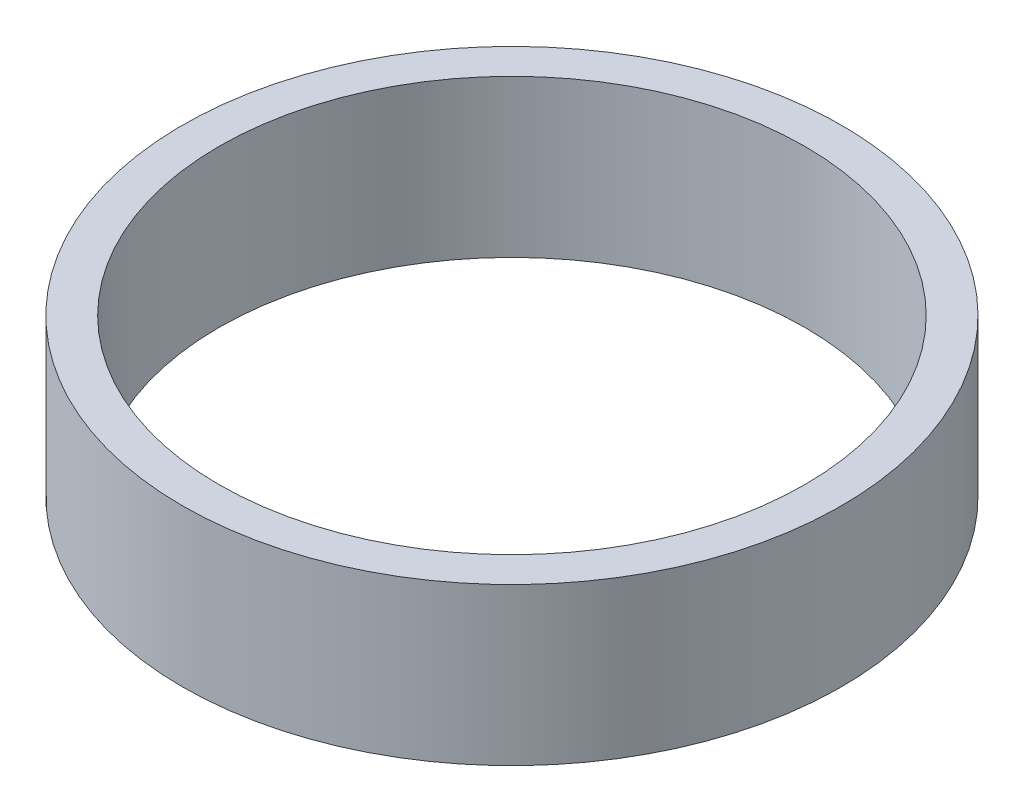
ISO-10303-21;
HEADER;
FILE_DESCRIPTION(('STEP AP214'),'2;1');
FILE_NAME('part.step','',(''),(''),'','','');
FILE_SCHEMA(('AUTOMOTIVE_DESIGN { 1 0 10303 214 1 1 1 1 }'));
ENDSEC;
DATA;
#1=APPLICATION_CONTEXT('core data for automotive mechanical design processes');
#2=APPLICATION_PROTOCOL_DEFINITION('international standard','automotive_design',2000,#1);
#3=PRODUCT_CONTEXT('',#1,'mechanical');
#4=PRODUCT('Part','Part','',(#3));
#5=PRODUCT_RELATED_PRODUCT_CATEGORY('part','',(#4));
#6=PRODUCT_DEFINITION_FORMATION('','',#4);
#7=PRODUCT_DEFINITION_CONTEXT('part definition',#1,'design');
#8=PRODUCT_DEFINITION('design','',#6,#7);
#9=PRODUCT_DEFINITION_SHAPE('','',#8);
#10=(LENGTH_UNIT() NAMED_UNIT(*) SI_UNIT(.MILLI.,.METRE.));
#11=(NAMED_UNIT(*) PLANE_ANGLE_UNIT() SI_UNIT($,.RADIAN.));
#12=(NAMED_UNIT(*) SI_UNIT($,.STERADIAN.) SOLID_ANGLE_UNIT());
#13=UNCERTAINTY_MEASURE_WITH_UNIT(LENGTH_MEASURE(1.E-05),#10,'distance_accuracy_value','');
#14=(GEOMETRIC_REPRESENTATION_CONTEXT(3) GLOBAL_UNCERTAINTY_ASSIGNED_CONTEXT((#13)) GLOBAL_UNIT_ASSIGNED_CONTEXT((#10,
#11,#12)) REPRESENTATION_CONTEXT('',''));
#15=CARTESIAN_POINT('',(0.,0.,0.));
#16=DIRECTION('',(0.,0.,1.));
#17=DIRECTION('',(1.,0.,0.));
#18=AXIS2_PLACEMENT_3D('',#15,#16,#17);
#19=CARTESIAN_POINT('',(0.,8.5663204,0.));
#20=DIRECTION('',(0.,1.,0.));
#21=DIRECTION('',(0.,0.,1.));
#22=AXIS2_PLACEMENT_3D('',#19,#20,#21);
#23=PLANE('',#22);
#24=CARTESIAN_POINT('',(0.,8.5663204,0.));
#25=DIRECTION('',(0.,1.,0.));
#26=DIRECTION('',(0.,0.,1.));
#27=AXIS2_PLACEMENT_3D('',#24,#25,#26);
#28=CIRCLE('',#27,18.);
#29=CARTESIAN_POINT('',(0.,8.5663204,18.));
#30=VERTEX_POINT('',#29);
#31=EDGE_CURVE('E10',#30,#30,#28,.T.);
#32=ORIENTED_EDGE('',*,*,#31,.T.);
#33=EDGE_LOOP('',(#32));
#34=FACE_BOUND('',#33,.T.);
#35=CARTESIAN_POINT('',(0.,8.5663204,0.));
#36=DIRECTION('',(0.,1.,0.));
#37=DIRECTION('',(0.,0.,1.));
#38=AXIS2_PLACEMENT_3D('',#35,#36,#37);
#39=CIRCLE('',#38,16.);
#40=CARTESIAN_POINT('',(0.,8.5663204,16.));
#41=VERTEX_POINT('',#40);
#42=EDGE_CURVE('E45',#41,#41,#39,.T.);
#43=ORIENTED_EDGE('',*,*,#42,.F.);
#44=EDGE_LOOP('',(#43));
#45=FACE_BOUND('',#44,.T.);
#46=ADVANCED_FACE('F34',(#34,#45),#23,.T.);
#47=CARTESIAN_POINT('',(0.,0.,0.));
#48=DIRECTION('',(0.,1.,0.));
#49=DIRECTION('',(0.,0.,1.));
#50=AXIS2_PLACEMENT_3D('',#47,#48,#49);
#51=PLANE('',#50);
#52=CARTESIAN_POINT('',(0.,0.,0.));
#53=DIRECTION('',(0.,1.,0.));
#54=DIRECTION('',(0.,0.,1.));
#55=AXIS2_PLACEMENT_3D('',#52,#53,#54);
#56=CIRCLE('',#55,18.);
#57=CARTESIAN_POINT('',(0.,0.,18.));
#58=VERTEX_POINT('',#57);
#59=EDGE_CURVE('E38',#58,#58,#56,.T.);
#60=ORIENTED_EDGE('',*,*,#59,.F.);
#61=EDGE_LOOP('',(#60));
#62=FACE_BOUND('',#61,.T.);
#63=CARTESIAN_POINT('',(0.,0.,0.));
#64=DIRECTION('',(0.,1.,0.));
#65=DIRECTION('',(0.,0.,1.));
#66=AXIS2_PLACEMENT_3D('',#63,#64,#65);
#67=CIRCLE('',#66,16.);
#68=CARTESIAN_POINT('',(0.,0.,16.));
#69=VERTEX_POINT('',#68);
#70=EDGE_CURVE('E47',#69,#69,#67,.T.);
#71=ORIENTED_EDGE('',*,*,#70,.T.);
#72=EDGE_LOOP('',(#71));
#73=FACE_BOUND('',#72,.T.);
#74=ADVANCED_FACE('F57',(#62,#73),#51,.F.);
#75=CARTESIAN_POINT('',(0.,8.5663204,0.));
#76=DIRECTION('',(0.,-1.,0.));
#77=DIRECTION('',(0.,0.,-1.));
#78=AXIS2_PLACEMENT_3D('',#75,#76,#77);
#79=CYLINDRICAL_SURFACE('',#78,18.);
#80=ORIENTED_EDGE('',*,*,#31,.F.);
#81=EDGE_LOOP('',(#80));
#82=FACE_BOUND('',#81,.T.);
#83=ORIENTED_EDGE('',*,*,#59,.T.);
#84=EDGE_LOOP('',(#83));
#85=FACE_BOUND('',#84,.T.);
#86=ADVANCED_FACE('F36',(#82,#85),#79,.T.);
#87=CARTESIAN_POINT('',(0.,8.5663204,0.));
#88=DIRECTION('',(0.,-1.,0.));
#89=DIRECTION('',(0.,0.,-1.));
#90=AXIS2_PLACEMENT_3D('',#87,#88,#89);
#91=CYLINDRICAL_SURFACE('',#90,16.);
#92=ORIENTED_EDGE('',*,*,#42,.T.);
#93=EDGE_LOOP('',(#92));
#94=FACE_BOUND('',#93,.T.);
#95=ORIENTED_EDGE('',*,*,#70,.F.);
#96=EDGE_LOOP('',(#95));
#97=FACE_BOUND('',#96,.T.);
#98=ADVANCED_FACE('F53',(#94,#97),#91,.F.);
#99=CLOSED_SHELL('',(#46,#74,#86,#98));
#100=MANIFOLD_SOLID_BREP('B2',#99);
#101=ADVANCED_BREP_SHAPE_REPRESENTATION('',(#18,#100),#14);
#102=SHAPE_DEFINITION_REPRESENTATION(#9,#101);
ENDSEC;
END-ISO-10303-21;
